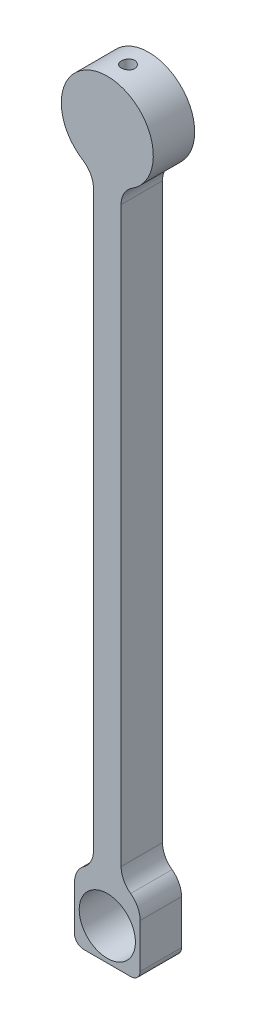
ISO-10303-21;
HEADER;
FILE_DESCRIPTION(('STEP AP214'),'2;1');
FILE_NAME('part.step','',(''),(''),'','','');
FILE_SCHEMA(('AUTOMOTIVE_DESIGN { 1 0 10303 214 1 1 1 1 }'));
ENDSEC;
DATA;
#1=APPLICATION_CONTEXT('core data for automotive mechanical design processes');
#2=APPLICATION_PROTOCOL_DEFINITION('international standard','automotive_design',2000,#1);
#3=PRODUCT_CONTEXT('',#1,'mechanical');
#4=PRODUCT('Part','Part','',(#3));
#5=PRODUCT_RELATED_PRODUCT_CATEGORY('part','',(#4));
#6=PRODUCT_DEFINITION_FORMATION('','',#4);
#7=PRODUCT_DEFINITION_CONTEXT('part definition',#1,'design');
#8=PRODUCT_DEFINITION('design','',#6,#7);
#9=PRODUCT_DEFINITION_SHAPE('','',#8);
#10=(LENGTH_UNIT() NAMED_UNIT(*) SI_UNIT(.MILLI.,.METRE.));
#11=(NAMED_UNIT(*) PLANE_ANGLE_UNIT() SI_UNIT($,.RADIAN.));
#12=(NAMED_UNIT(*) SI_UNIT($,.STERADIAN.) SOLID_ANGLE_UNIT());
#13=UNCERTAINTY_MEASURE_WITH_UNIT(LENGTH_MEASURE(1.E-05),#10,'distance_accuracy_value','');
#14=(GEOMETRIC_REPRESENTATION_CONTEXT(3) GLOBAL_UNCERTAINTY_ASSIGNED_CONTEXT((#13)) GLOBAL_UNIT_ASSIGNED_CONTEXT((#10,
#11,#12)) REPRESENTATION_CONTEXT('',''));
#15=CARTESIAN_POINT('',(0.,0.,0.));
#16=DIRECTION('',(0.,0.,1.));
#17=DIRECTION('',(1.,0.,0.));
#18=AXIS2_PLACEMENT_3D('',#15,#16,#17);
#19=CARTESIAN_POINT('',(0.,0.,9.));
#20=DIRECTION('',(0.,0.,-1.));
#21=DIRECTION('',(-1.,0.,0.));
#22=AXIS2_PLACEMENT_3D('',#19,#20,#21);
#23=CYLINDRICAL_SURFACE('',#22,3.3);
#24=DIRECTION('',(0.,0.,-1.));
#25=VECTOR('',#24,1.);
#26=CARTESIAN_POINT('',(-1.8629132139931,2.72388589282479,9.));
#27=LINE('',#26,#25);
#28=CARTESIAN_POINT('',(-1.8629132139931,2.72388589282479,7.));
#29=VERTEX_POINT('',#28);
#30=CARTESIAN_POINT('',(-1.8629132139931,2.72388589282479,0.));
#31=VERTEX_POINT('',#30);
#32=EDGE_CURVE('E169',#29,#31,#27,.T.);
#33=ORIENTED_EDGE('',*,*,#32,.F.);
#34=CARTESIAN_POINT('',(0.,0.,7.));
#35=DIRECTION('',(0.,0.,1.));
#36=DIRECTION('',(1.,0.,0.));
#37=AXIS2_PLACEMENT_3D('',#34,#35,#36);
#38=CIRCLE('',#37,3.3);
#39=CARTESIAN_POINT('',(1.8629132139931,2.72388589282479,7.));
#40=VERTEX_POINT('',#39);
#41=EDGE_CURVE('E173',#29,#40,#38,.T.);
#42=ORIENTED_EDGE('',*,*,#41,.T.);
#43=DIRECTION('',(0.,0.,-1.));
#44=VECTOR('',#43,1.);
#45=CARTESIAN_POINT('',(1.8629132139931,2.72388589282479,9.));
#46=LINE('',#45,#44);
#47=CARTESIAN_POINT('',(1.8629132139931,2.72388589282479,0.));
#48=VERTEX_POINT('',#47);
#49=EDGE_CURVE('E160',#40,#48,#46,.T.);
#50=ORIENTED_EDGE('',*,*,#49,.T.);
#51=CARTESIAN_POINT('',(0.,0.,0.));
#52=DIRECTION('',(0.,0.,1.));
#53=DIRECTION('',(1.,0.,0.));
#54=AXIS2_PLACEMENT_3D('',#51,#52,#53);
#55=CIRCLE('',#54,3.3);
#56=EDGE_CURVE('E265',#31,#48,#55,.T.);
#57=ORIENTED_EDGE('',*,*,#56,.F.);
#58=EDGE_LOOP('',(#33,#42,#50,#57));
#59=FACE_BOUND('',#58,.T.);
#60=ADVANCED_FACE('F42',(#59),#23,.F.);
#61=CARTESIAN_POINT('',(0.,2.72388589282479,9.));
#62=DIRECTION('',(0.,1.,0.));
#63=DIRECTION('',(0.,0.,1.));
#64=AXIS2_PLACEMENT_3D('',#61,#62,#63);
#65=PLANE('',#64);
#66=CARTESIAN_POINT('',(0.,2.72388589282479,4.5));
#67=DIRECTION('',(0.,1.,0.));
#68=DIRECTION('',(0.,0.,1.));
#69=AXIS2_PLACEMENT_3D('',#66,#67,#68);
#70=CIRCLE('',#69,1.45);
#71=CARTESIAN_POINT('',(0.,2.72388589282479,5.95));
#72=VERTEX_POINT('',#71);
#73=EDGE_CURVE('E176',#72,#72,#70,.T.);
#74=ORIENTED_EDGE('',*,*,#73,.T.);
#75=EDGE_LOOP('',(#74));
#76=FACE_BOUND('',#75,.T.);
#77=DIRECTION('',(-1.,0.,0.));
#78=VECTOR('',#77,1.);
#79=CARTESIAN_POINT('',(-1.8629132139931,2.72388589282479,7.));
#80=LINE('',#79,#78);
#81=EDGE_CURVE('E63',#40,#29,#80,.T.);
#82=ORIENTED_EDGE('',*,*,#81,.T.);
#83=ORIENTED_EDGE('',*,*,#32,.T.);
#84=DIRECTION('',(1.,0.,0.));
#85=VECTOR('',#84,1.);
#86=CARTESIAN_POINT('',(0.,2.72388589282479,0.));
#87=LINE('',#86,#85);
#88=EDGE_CURVE('E164',#31,#48,#87,.T.);
#89=ORIENTED_EDGE('',*,*,#88,.T.);
#90=ORIENTED_EDGE('',*,*,#49,.F.);
#91=EDGE_LOOP('',(#82,#83,#89,#90));
#92=FACE_BOUND('',#91,.T.);
#93=ADVANCED_FACE('F162',(#76,#92),#65,.F.);
#94=CARTESIAN_POINT('',(0.,0.,9.));
#95=DIRECTION('',(0.,0.,1.));
#96=DIRECTION('',(1.,0.,0.));
#97=AXIS2_PLACEMENT_3D('',#94,#95,#96);
#98=PLANE('',#97);
#99=CARTESIAN_POINT('',(-8.,-137.31142245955,9.));
#100=DIRECTION('',(0.,0.,-1.));
#101=DIRECTION('',(-1.,0.,0.));
#102=AXIS2_PLACEMENT_3D('',#99,#100,#101);
#103=CIRCLE('',#102,5.00000000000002);
#104=CARTESIAN_POINT('',(-5.07071421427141,-141.363494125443,9.));
#105=VERTEX_POINT('',#104);
#106=CARTESIAN_POINT('',(-3.,-137.31142245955,9.));
#107=VERTEX_POINT('',#106);
#108=EDGE_CURVE('E180',#105,#107,#103,.F.);
#109=ORIENTED_EDGE('',*,*,#108,.F.);
#110=CARTESIAN_POINT('',(-2.14142842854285,-145.415565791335,9.));
#111=DIRECTION('',(0.,0.,1.));
#112=DIRECTION('',(1.,0.,0.));
#113=AXIS2_PLACEMENT_3D('',#110,#111,#112);
#114=CIRCLE('',#113,5.);
#115=CARTESIAN_POINT('',(-7.14142842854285,-145.415565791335,9.));
#116=VERTEX_POINT('',#115);
#117=EDGE_CURVE('E305',#105,#116,#114,.T.);
#118=ORIENTED_EDGE('',*,*,#117,.T.);
#119=DIRECTION('',(0.,1.,0.));
#120=VECTOR('',#119,1.);
#121=CARTESIAN_POINT('',(-7.14142842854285,-157.,9.));
#122=LINE('',#121,#120);
#123=CARTESIAN_POINT('',(-7.14142842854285,-155.,9.));
#124=VERTEX_POINT('',#123);
#125=EDGE_CURVE('E242',#124,#116,#122,.T.);
#126=ORIENTED_EDGE('',*,*,#125,.F.);
#127=CARTESIAN_POINT('',(-5.14142842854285,-155.,9.));
#128=DIRECTION('',(0.,0.,1.));
#129=DIRECTION('',(1.,0.,0.));
#130=AXIS2_PLACEMENT_3D('',#127,#128,#129);
#131=CIRCLE('',#130,2.);
#132=CARTESIAN_POINT('',(-5.14142842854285,-157.,9.));
#133=VERTEX_POINT('',#132);
#134=EDGE_CURVE('E364',#124,#133,#131,.T.);
#135=ORIENTED_EDGE('',*,*,#134,.T.);
#136=DIRECTION('',(-1.,0.,0.));
#137=VECTOR('',#136,1.);
#138=CARTESIAN_POINT('',(7.14142842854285,-157.,9.));
#139=LINE('',#138,#137);
#140=CARTESIAN_POINT('',(5.14142842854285,-157.,9.));
#141=VERTEX_POINT('',#140);
#142=EDGE_CURVE('E238',#141,#133,#139,.T.);
#143=ORIENTED_EDGE('',*,*,#142,.F.);
#144=CARTESIAN_POINT('',(5.14142842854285,-155.,9.));
#145=DIRECTION('',(0.,0.,1.));
#146=DIRECTION('',(1.,0.,0.));
#147=AXIS2_PLACEMENT_3D('',#144,#145,#146);
#148=CIRCLE('',#147,2.);
#149=CARTESIAN_POINT('',(7.14142842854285,-155.,9.));
#150=VERTEX_POINT('',#149);
#151=EDGE_CURVE('E323',#141,#150,#148,.T.);
#152=ORIENTED_EDGE('',*,*,#151,.T.);
#153=DIRECTION('',(0.,1.,0.));
#154=VECTOR('',#153,1.);
#155=CARTESIAN_POINT('',(7.14142842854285,-157.,9.));
#156=LINE('',#155,#154);
#157=CARTESIAN_POINT('',(7.14142842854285,-145.415565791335,9.));
#158=VERTEX_POINT('',#157);
#159=EDGE_CURVE('E246',#150,#158,#156,.T.);
#160=ORIENTED_EDGE('',*,*,#159,.T.);
#161=CARTESIAN_POINT('',(2.14142842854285,-145.415565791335,9.));
#162=DIRECTION('',(0.,0.,1.));
#163=DIRECTION('',(1.,0.,0.));
#164=AXIS2_PLACEMENT_3D('',#161,#162,#163);
#165=CIRCLE('',#164,5.);
#166=CARTESIAN_POINT('',(5.07071421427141,-141.363494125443,9.));
#167=VERTEX_POINT('',#166);
#168=EDGE_CURVE('E71',#158,#167,#165,.T.);
#169=ORIENTED_EDGE('',*,*,#168,.T.);
#170=CARTESIAN_POINT('',(8.,-137.31142245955,9.));
#171=DIRECTION('',(0.,0.,-1.));
#172=DIRECTION('',(-1.,0.,0.));
#173=AXIS2_PLACEMENT_3D('',#170,#171,#172);
#174=CIRCLE('',#173,5.00000000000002);
#175=CARTESIAN_POINT('',(3.,-137.31142245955,9.));
#176=VERTEX_POINT('',#175);
#177=EDGE_CURVE('E187',#167,#176,#174,.T.);
#178=ORIENTED_EDGE('',*,*,#177,.T.);
#179=DIRECTION('',(0.,-1.,0.));
#180=VECTOR('',#179,1.);
#181=CARTESIAN_POINT('',(3.,0.,9.));
#182=LINE('',#181,#180);
#183=CARTESIAN_POINT('',(3.,-12.6885775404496,9.));
#184=VERTEX_POINT('',#183);
#185=EDGE_CURVE('E190',#184,#176,#182,.T.);
#186=ORIENTED_EDGE('',*,*,#185,.F.);
#187=CARTESIAN_POINT('',(8.,-12.6885775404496,9.));
#188=DIRECTION('',(0.,0.,-1.));
#189=DIRECTION('',(-1.,0.,0.));
#190=AXIS2_PLACEMENT_3D('',#187,#188,#189);
#191=CIRCLE('',#190,5.00000000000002);
#192=CARTESIAN_POINT('',(5.33333333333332,-8.45905169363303,9.));
#193=VERTEX_POINT('',#192);
#194=EDGE_CURVE('E195',#193,#184,#191,.F.);
#195=ORIENTED_EDGE('',*,*,#194,.F.);
#196=CARTESIAN_POINT('',(0.,0.,9.));
#197=DIRECTION('',(0.,0.,1.));
#198=DIRECTION('',(1.,0.,0.));
#199=AXIS2_PLACEMENT_3D('',#196,#197,#198);
#200=CIRCLE('',#199,10.);
#201=CARTESIAN_POINT('',(-5.33333333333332,-8.45905169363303,9.));
#202=VERTEX_POINT('',#201);
#203=EDGE_CURVE('E170',#193,#202,#200,.T.);
#204=ORIENTED_EDGE('',*,*,#203,.T.);
#205=CARTESIAN_POINT('',(-8.,-12.6885775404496,9.));
#206=DIRECTION('',(0.,0.,-1.));
#207=DIRECTION('',(-1.,0.,0.));
#208=AXIS2_PLACEMENT_3D('',#205,#206,#207);
#209=CIRCLE('',#208,5.00000000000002);
#210=CARTESIAN_POINT('',(-3.,-12.6885775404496,9.));
#211=VERTEX_POINT('',#210);
#212=EDGE_CURVE('E183',#202,#211,#209,.T.);
#213=ORIENTED_EDGE('',*,*,#212,.T.);
#214=DIRECTION('',(0.,-1.,0.));
#215=VECTOR('',#214,1.);
#216=CARTESIAN_POINT('',(-3.,0.,9.));
#217=LINE('',#216,#215);
#218=EDGE_CURVE('E213',#211,#107,#217,.T.);
#219=ORIENTED_EDGE('',*,*,#218,.T.);
#220=EDGE_LOOP('',(#109,#118,#126,#135,#143,#152,#160,#169,#178,#186,#195,#204,#213,#219));
#221=FACE_BOUND('',#220,.T.);
#222=CARTESIAN_POINT('',(0.,-150.,9.));
#223=DIRECTION('',(0.,0.,1.));
#224=DIRECTION('',(1.,0.,0.));
#225=AXIS2_PLACEMENT_3D('',#222,#223,#224);
#226=CIRCLE('',#225,6.11);
#227=CARTESIAN_POINT('',(6.11,-150.,9.));
#228=VERTEX_POINT('',#227);
#229=EDGE_CURVE('E230',#228,#228,#226,.T.);
#230=ORIENTED_EDGE('',*,*,#229,.F.);
#231=EDGE_LOOP('',(#230));
#232=FACE_BOUND('',#231,.T.);
#233=ADVANCED_FACE('F320',(#221,#232),#98,.T.);
#234=CARTESIAN_POINT('',(0.,0.,0.));
#235=DIRECTION('',(0.,0.,1.));
#236=DIRECTION('',(1.,0.,0.));
#237=AXIS2_PLACEMENT_3D('',#234,#235,#236);
#238=PLANE('',#237);
#239=DIRECTION('',(0.,1.,0.));
#240=VECTOR('',#239,1.);
#241=CARTESIAN_POINT('',(-7.14142842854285,-157.,0.));
#242=LINE('',#241,#240);
#243=CARTESIAN_POINT('',(-7.14142842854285,-155.,0.));
#244=VERTEX_POINT('',#243);
#245=CARTESIAN_POINT('',(-7.14142842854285,-145.415565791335,0.));
#246=VERTEX_POINT('',#245);
#247=EDGE_CURVE('E259',#244,#246,#242,.T.);
#248=ORIENTED_EDGE('',*,*,#247,.T.);
#249=CARTESIAN_POINT('',(-2.14142842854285,-145.415565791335,0.));
#250=DIRECTION('',(0.,0.,1.));
#251=DIRECTION('',(1.,0.,0.));
#252=AXIS2_PLACEMENT_3D('',#249,#250,#251);
#253=CIRCLE('',#252,5.);
#254=CARTESIAN_POINT('',(-5.07071421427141,-141.363494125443,0.));
#255=VERTEX_POINT('',#254);
#256=EDGE_CURVE('E297',#246,#255,#253,.F.);
#257=ORIENTED_EDGE('',*,*,#256,.T.);
#258=CARTESIAN_POINT('',(-8.,-137.31142245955,0.));
#259=DIRECTION('',(0.,0.,1.));
#260=DIRECTION('',(1.,0.,0.));
#261=AXIS2_PLACEMENT_3D('',#258,#259,#260);
#262=CIRCLE('',#261,5.00000000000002);
#263=CARTESIAN_POINT('',(-3.,-137.31142245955,0.));
#264=VERTEX_POINT('',#263);
#265=EDGE_CURVE('E266',#264,#255,#262,.F.);
#266=ORIENTED_EDGE('',*,*,#265,.F.);
#267=DIRECTION('',(0.,1.,0.));
#268=VECTOR('',#267,1.);
#269=CARTESIAN_POINT('',(-3.,0.,0.));
#270=LINE('',#269,#268);
#271=CARTESIAN_POINT('',(-3.,-12.6885775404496,0.));
#272=VERTEX_POINT('',#271);
#273=EDGE_CURVE('E270',#264,#272,#270,.T.);
#274=ORIENTED_EDGE('',*,*,#273,.T.);
#275=CARTESIAN_POINT('',(-8.,-12.6885775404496,0.));
#276=DIRECTION('',(0.,0.,1.));
#277=DIRECTION('',(1.,0.,0.));
#278=AXIS2_PLACEMENT_3D('',#275,#276,#277);
#279=CIRCLE('',#278,5.00000000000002);
#280=CARTESIAN_POINT('',(-5.33333333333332,-8.45905169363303,0.));
#281=VERTEX_POINT('',#280);
#282=EDGE_CURVE('E271',#272,#281,#279,.T.);
#283=ORIENTED_EDGE('',*,*,#282,.T.);
#284=CARTESIAN_POINT('',(0.,0.,0.));
#285=DIRECTION('',(0.,0.,1.));
#286=DIRECTION('',(1.,0.,0.));
#287=AXIS2_PLACEMENT_3D('',#284,#285,#286);
#288=CIRCLE('',#287,10.);
#289=CARTESIAN_POINT('',(5.33333333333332,-8.45905169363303,0.));
#290=VERTEX_POINT('',#289);
#291=EDGE_CURVE('E344',#290,#281,#288,.T.);
#292=ORIENTED_EDGE('',*,*,#291,.F.);
#293=CARTESIAN_POINT('',(8.,-12.6885775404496,0.));
#294=DIRECTION('',(0.,0.,1.));
#295=DIRECTION('',(1.,0.,0.));
#296=AXIS2_PLACEMENT_3D('',#293,#294,#295);
#297=CIRCLE('',#296,5.00000000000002);
#298=CARTESIAN_POINT('',(3.,-12.6885775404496,0.));
#299=VERTEX_POINT('',#298);
#300=EDGE_CURVE('E280',#299,#290,#297,.F.);
#301=ORIENTED_EDGE('',*,*,#300,.F.);
#302=DIRECTION('',(0.,1.,0.));
#303=VECTOR('',#302,1.);
#304=CARTESIAN_POINT('',(3.,0.,0.));
#305=LINE('',#304,#303);
#306=CARTESIAN_POINT('',(3.,-137.31142245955,0.));
#307=VERTEX_POINT('',#306);
#308=EDGE_CURVE('E279',#307,#299,#305,.T.);
#309=ORIENTED_EDGE('',*,*,#308,.F.);
#310=CARTESIAN_POINT('',(8.,-137.31142245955,0.));
#311=DIRECTION('',(0.,0.,1.));
#312=DIRECTION('',(1.,0.,0.));
#313=AXIS2_PLACEMENT_3D('',#310,#311,#312);
#314=CIRCLE('',#313,5.00000000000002);
#315=CARTESIAN_POINT('',(5.07071421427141,-141.363494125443,0.));
#316=VERTEX_POINT('',#315);
#317=EDGE_CURVE('E275',#307,#316,#314,.T.);
#318=ORIENTED_EDGE('',*,*,#317,.T.);
#319=CARTESIAN_POINT('',(2.14142842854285,-145.415565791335,0.));
#320=DIRECTION('',(0.,0.,1.));
#321=DIRECTION('',(1.,0.,0.));
#322=AXIS2_PLACEMENT_3D('',#319,#320,#321);
#323=CIRCLE('',#322,5.);
#324=CARTESIAN_POINT('',(7.14142842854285,-145.415565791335,0.));
#325=VERTEX_POINT('',#324);
#326=EDGE_CURVE('E294',#316,#325,#323,.F.);
#327=ORIENTED_EDGE('',*,*,#326,.T.);
#328=DIRECTION('',(0.,1.,0.));
#329=VECTOR('',#328,1.);
#330=CARTESIAN_POINT('',(7.14142842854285,-157.,0.));
#331=LINE('',#330,#329);
#332=CARTESIAN_POINT('',(7.14142842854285,-155.,0.));
#333=VERTEX_POINT('',#332);
#334=EDGE_CURVE('E249',#333,#325,#331,.T.);
#335=ORIENTED_EDGE('',*,*,#334,.F.);
#336=CARTESIAN_POINT('',(5.14142842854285,-155.,0.));
#337=DIRECTION('',(0.,0.,1.));
#338=DIRECTION('',(1.,0.,0.));
#339=AXIS2_PLACEMENT_3D('',#336,#337,#338);
#340=CIRCLE('',#339,2.);
#341=CARTESIAN_POINT('',(5.14142842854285,-157.,0.));
#342=VERTEX_POINT('',#341);
#343=EDGE_CURVE('E374',#333,#342,#340,.F.);
#344=ORIENTED_EDGE('',*,*,#343,.T.);
#345=DIRECTION('',(1.,0.,0.));
#346=VECTOR('',#345,1.);
#347=CARTESIAN_POINT('',(-7.14142842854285,-157.,0.));
#348=LINE('',#347,#346);
#349=CARTESIAN_POINT('',(-5.14142842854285,-157.,0.));
#350=VERTEX_POINT('',#349);
#351=EDGE_CURVE('E234',#350,#342,#348,.T.);
#352=ORIENTED_EDGE('',*,*,#351,.F.);
#353=CARTESIAN_POINT('',(-5.14142842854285,-155.,0.));
#354=DIRECTION('',(0.,0.,1.));
#355=DIRECTION('',(1.,0.,0.));
#356=AXIS2_PLACEMENT_3D('',#353,#354,#355);
#357=CIRCLE('',#356,2.);
#358=EDGE_CURVE('E372',#350,#244,#357,.F.);
#359=ORIENTED_EDGE('',*,*,#358,.T.);
#360=EDGE_LOOP('',(#248,#257,#266,#274,#283,#292,#301,#309,#318,#327,#335,#344,#352,#359));
#361=FACE_BOUND('',#360,.T.);
#362=CARTESIAN_POINT('',(0.,-150.,0.));
#363=DIRECTION('',(0.,0.,-1.));
#364=DIRECTION('',(-1.,0.,0.));
#365=AXIS2_PLACEMENT_3D('',#362,#363,#364);
#366=CIRCLE('',#365,6.11);
#367=CARTESIAN_POINT('',(-6.11,-150.,0.));
#368=VERTEX_POINT('',#367);
#369=EDGE_CURVE('E203',#368,#368,#366,.T.);
#370=ORIENTED_EDGE('',*,*,#369,.F.);
#371=EDGE_LOOP('',(#370));
#372=FACE_BOUND('',#371,.T.);
#373=ORIENTED_EDGE('',*,*,#56,.T.);
#374=ORIENTED_EDGE('',*,*,#88,.F.);
#375=EDGE_LOOP('',(#373,#374));
#376=FACE_BOUND('',#375,.T.);
#377=ADVANCED_FACE('F330',(#361,#372,#376),#238,.F.);
#378=CARTESIAN_POINT('',(7.14142842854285,-157.,0.));
#379=DIRECTION('',(-1.,0.,0.));
#380=DIRECTION('',(0.,0.,1.));
#381=AXIS2_PLACEMENT_3D('',#378,#379,#380);
#382=PLANE('',#381);
#383=ORIENTED_EDGE('',*,*,#334,.T.);
#384=DIRECTION('',(0.,0.,-1.));
#385=VECTOR('',#384,1.);
#386=CARTESIAN_POINT('',(7.14142842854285,-145.415565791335,0.));
#387=LINE('',#386,#385);
#388=EDGE_CURVE('E56',#325,#158,#387,.F.);
#389=ORIENTED_EDGE('',*,*,#388,.T.);
#390=ORIENTED_EDGE('',*,*,#159,.F.);
#391=DIRECTION('',(0.,0.,1.));
#392=VECTOR('',#391,1.);
#393=CARTESIAN_POINT('',(7.14142842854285,-155.,0.));
#394=LINE('',#393,#392);
#395=EDGE_CURVE('E369',#150,#333,#394,.F.);
#396=ORIENTED_EDGE('',*,*,#395,.T.);
#397=EDGE_LOOP('',(#383,#389,#390,#396));
#398=FACE_BOUND('',#397,.T.);
#399=ADVANCED_FACE('F315',(#398),#382,.F.);
#400=CARTESIAN_POINT('',(0.,0.,9.));
#401=DIRECTION('',(0.,0.,-1.));
#402=DIRECTION('',(-1.,0.,0.));
#403=AXIS2_PLACEMENT_3D('',#400,#401,#402);
#404=CYLINDRICAL_SURFACE('',#403,10.);
#405=CARTESIAN_POINT('',(0.,10.,5.95));
#406=CARTESIAN_POINT('',(-0.0809915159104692,9.9999987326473,5.94999663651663));
#407=CARTESIAN_POINT('',(-0.162030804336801,9.99900572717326,5.94319127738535));
#408=CARTESIAN_POINT('',(-0.321846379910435,9.99513998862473,5.91615530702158));
#409=CARTESIAN_POINT('',(-0.400620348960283,9.99226539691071,5.89591142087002));
#410=CARTESIAN_POINT('',(-0.553569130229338,9.984959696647,5.84261417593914));
#411=CARTESIAN_POINT('',(-0.627747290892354,9.98052973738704,5.80957027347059));
#412=CARTESIAN_POINT('',(-0.769493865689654,9.97060349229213,5.73163360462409));
#413=CARTESIAN_POINT('',(-0.837063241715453,9.96510736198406,5.6867425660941));
#414=CARTESIAN_POINT('',(-0.964180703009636,9.95361550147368,5.58603558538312));
#415=CARTESIAN_POINT('',(-1.02367340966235,9.94761673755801,5.53015008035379));
#416=CARTESIAN_POINT('',(-1.13247112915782,9.93581960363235,5.40919020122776));
#417=CARTESIAN_POINT('',(-1.18177557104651,9.93002124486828,5.34411531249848));
#418=CARTESIAN_POINT('',(-1.26901088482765,9.91925193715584,5.20625428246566));
#419=CARTESIAN_POINT('',(-1.30688852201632,9.91428490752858,5.13343412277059));
#420=CARTESIAN_POINT('',(-1.36985487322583,9.90578181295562,4.98238163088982));
#421=CARTESIAN_POINT('',(-1.39494423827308,9.90224567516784,4.90414957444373));
#422=CARTESIAN_POINT('',(-1.43145060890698,9.89703441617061,4.74507496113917));
#423=CARTESIAN_POINT('',(-1.44296217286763,9.89534643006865,4.66425453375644));
#424=CARTESIAN_POINT('',(-1.45227903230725,9.8939834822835,4.50181281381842));
#425=CARTESIAN_POINT('',(-1.45008506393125,9.89430841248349,4.42019156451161));
#426=CARTESIAN_POINT('',(-1.43213048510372,9.896922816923,4.25913116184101));
#427=CARTESIAN_POINT('',(-1.41647493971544,9.89919707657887,4.17968001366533));
#428=CARTESIAN_POINT('',(-1.37220596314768,9.90543013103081,4.02454437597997));
#429=CARTESIAN_POINT('',(-1.34359218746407,9.90938897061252,3.94885998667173));
#430=CARTESIAN_POINT('',(-1.27410893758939,9.91856202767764,3.80308516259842));
#431=CARTESIAN_POINT('',(-1.23319471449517,9.92378081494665,3.73301635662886));
#432=CARTESIAN_POINT('',(-1.14030387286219,9.93488239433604,3.60069901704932));
#433=CARTESIAN_POINT('',(-1.08832657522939,9.94076522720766,3.53845096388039));
#434=CARTESIAN_POINT('',(-0.974207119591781,9.95259936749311,3.42293300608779));
#435=CARTESIAN_POINT('',(-0.911974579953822,9.95855080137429,3.36975236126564));
#436=CARTESIAN_POINT('',(-0.779419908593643,9.96980047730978,3.2745768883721));
#437=CARTESIAN_POINT('',(-0.709097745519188,9.9750987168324,3.23258210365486));
#438=CARTESIAN_POINT('',(-0.562284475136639,9.98445005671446,3.16096681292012));
#439=CARTESIAN_POINT('',(-0.485790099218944,9.98850249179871,3.13135291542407));
#440=CARTESIAN_POINT('',(-0.328842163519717,9.99489997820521,3.08541617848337));
#441=CARTESIAN_POINT('',(-0.248388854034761,9.99724513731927,3.06909249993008));
#442=CARTESIAN_POINT('',(-0.0865774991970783,9.99994961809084,3.05031761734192));
#443=CARTESIAN_POINT('',(-0.00523398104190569,10.0003265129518,3.04774364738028));
#444=CARTESIAN_POINT('',(0.156723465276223,9.99909975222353,3.05621579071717));
#445=CARTESIAN_POINT('',(0.237337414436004,9.9974961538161,3.06726151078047));
#446=CARTESIAN_POINT('',(0.39517758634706,9.99249946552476,3.10255741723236));
#447=CARTESIAN_POINT('',(0.472417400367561,9.98911444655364,3.12674806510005));
#448=CARTESIAN_POINT('',(0.621744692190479,9.98093335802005,3.18758454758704));
#449=CARTESIAN_POINT('',(0.693831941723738,9.97613722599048,3.22423093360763));
#450=CARTESIAN_POINT('',(0.831349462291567,9.96562352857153,3.30922857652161));
#451=CARTESIAN_POINT('',(0.896730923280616,9.95989989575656,3.35765803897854));
#452=CARTESIAN_POINT('',(1.01848194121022,9.94818790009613,3.46473784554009));
#453=CARTESIAN_POINT('',(1.07485101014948,9.94219952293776,3.52338874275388));
#454=CARTESIAN_POINT('',(1.17742146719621,9.93057755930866,3.64979187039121));
#455=CARTESIAN_POINT('',(1.22354075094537,9.92494707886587,3.71761105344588));
#456=CARTESIAN_POINT('',(1.30373253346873,9.91473259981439,3.86010566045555));
#457=CARTESIAN_POINT('',(1.33780534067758,9.91014857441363,3.93478090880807));
#458=CARTESIAN_POINT('',(1.39280849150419,9.90256825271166,4.08861877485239));
#459=CARTESIAN_POINT('',(1.41378269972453,9.89956666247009,4.16776543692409));
#460=CARTESIAN_POINT('',(1.44213326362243,9.89547675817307,4.32850446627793));
#461=CARTESIAN_POINT('',(1.44951049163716,9.89438832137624,4.41009667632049));
#462=CARTESIAN_POINT('',(1.45043794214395,9.89425233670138,4.57259270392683));
#463=CARTESIAN_POINT('',(1.44411723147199,9.89518573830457,4.65349579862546));
#464=CARTESIAN_POINT('',(1.41810410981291,9.89894695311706,4.81307573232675));
#465=CARTESIAN_POINT('',(1.39841171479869,9.90177476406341,4.89175257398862));
#466=CARTESIAN_POINT('',(1.34625875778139,9.90899967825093,5.04461487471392));
#467=CARTESIAN_POINT('',(1.31380662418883,9.91339574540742,5.1188032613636));
#468=CARTESIAN_POINT('',(1.23706815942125,9.92326319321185,5.26070311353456));
#469=CARTESIAN_POINT('',(1.19278148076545,9.92873460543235,5.32841438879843));
#470=CARTESIAN_POINT('',(1.09315992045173,9.94019772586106,5.45609462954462));
#471=CARTESIAN_POINT('',(1.03772929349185,9.94619366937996,5.5159885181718));
#472=CARTESIAN_POINT('',(0.917595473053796,9.95799445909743,5.62567089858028));
#473=CARTESIAN_POINT('',(0.852890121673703,9.96379926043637,5.67545703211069));
#474=CARTESIAN_POINT('',(0.715654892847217,9.97459753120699,5.7637368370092));
#475=CARTESIAN_POINT('',(0.643086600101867,9.9795866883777,5.80217130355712));
#476=CARTESIAN_POINT('',(0.492488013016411,9.98814904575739,5.86624963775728));
#477=CARTESIAN_POINT('',(0.414463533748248,9.99172372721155,5.89190689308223));
#478=CARTESIAN_POINT('',(0.280064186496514,9.99622850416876,5.9238125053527));
#479=CARTESIAN_POINT('',(0.224523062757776,9.99763563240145,5.93361800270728));
#480=CARTESIAN_POINT('',(0.112662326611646,9.99952181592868,5.94671288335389));
#481=CARTESIAN_POINT('',(0.0563427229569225,10.0000008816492,5.95000233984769));
#482=CARTESIAN_POINT('',(0.,10.,5.95));
#483=B_SPLINE_CURVE_WITH_KNOTS('',3,(#405,#406,#407,#408,#409,#410,#411,#412,#413,#414,#415,
#416,#417,#418,#419,#420,#421,#422,#423,#424,#425,#426,#427,#428,#429,#430,#431,#432,#433,#434,
#435,#436,#437,#438,#439,#440,#441,#442,#443,#444,#445,#446,#447,#448,#449,#450,#451,#452,#453,
#454,#455,#456,#457,#458,#459,#460,#461,#462,#463,#464,#465,#466,#467,#468,#469,#470,#471,#472,
#473,#474,#475,#476,#477,#478,#479,#480,#481,#482),.UNSPECIFIED.,.T.,.F.,(4,2,2,2,2,2,2,2,2,2,2,
2,2,2,2,2,2,2,2,2,2,2,2,2,2,2,2,2,2,2,2,2,2,2,2,2,2,2,4),(0.,0.242768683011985,
0.485777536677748,0.728607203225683,0.971401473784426,1.21578441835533,1.46018105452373,
1.7056992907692,1.95120502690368,2.19499072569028,2.43876333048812,2.68065042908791,
2.92254395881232,3.16532836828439,3.40812768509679,3.65319411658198,3.89826149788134,
4.14345952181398,4.38864206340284,4.63163175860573,4.87461443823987,5.11650561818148,
5.35840750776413,5.60196095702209,5.84552758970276,6.09098008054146,6.33642628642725,
6.58104607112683,6.82565016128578,7.06795953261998,7.31026861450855,7.55241790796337,
7.79457431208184,8.03890773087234,8.28329809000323,8.52894143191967,8.77432684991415,
8.94321370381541,9.11209866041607),.UNSPECIFIED.);
#484=CARTESIAN_POINT('',(0.,10.,5.95));
#485=VERTEX_POINT('',#484);
#486=EDGE_CURVE('E12',#485,#485,#483,.T.);
#487=ORIENTED_EDGE('',*,*,#486,.T.);
#488=EDGE_LOOP('',(#487));
#489=FACE_BOUND('',#488,.T.);
#490=ORIENTED_EDGE('',*,*,#291,.T.);
#491=DIRECTION('',(0.,0.,-1.));
#492=VECTOR('',#491,1.);
#493=CARTESIAN_POINT('',(-5.33333333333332,-8.45905169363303,9.));
#494=LINE('',#493,#492);
#495=EDGE_CURVE('E217',#202,#281,#494,.T.);
#496=ORIENTED_EDGE('',*,*,#495,.F.);
#497=ORIENTED_EDGE('',*,*,#203,.F.);
#498=DIRECTION('',(0.,0.,-1.));
#499=VECTOR('',#498,1.);
#500=CARTESIAN_POINT('',(5.33333333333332,-8.45905169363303,9.));
#501=LINE('',#500,#499);
#502=EDGE_CURVE('E199',#193,#290,#501,.T.);
#503=ORIENTED_EDGE('',*,*,#502,.T.);
#504=EDGE_LOOP('',(#490,#496,#497,#503));
#505=FACE_BOUND('',#504,.T.);
#506=ADVANCED_FACE('F343',(#489,#505),#404,.T.);
#507=CARTESIAN_POINT('',(-7.14142842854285,-157.,9.));
#508=DIRECTION('',(1.,0.,0.));
#509=DIRECTION('',(0.,0.,-1.));
#510=AXIS2_PLACEMENT_3D('',#507,#508,#509);
#511=PLANE('',#510);
#512=ORIENTED_EDGE('',*,*,#125,.T.);
#513=DIRECTION('',(0.,0.,1.));
#514=VECTOR('',#513,1.);
#515=CARTESIAN_POINT('',(-7.14142842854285,-145.415565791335,0.));
#516=LINE('',#515,#514);
#517=EDGE_CURVE('E284',#116,#246,#516,.F.);
#518=ORIENTED_EDGE('',*,*,#517,.T.);
#519=ORIENTED_EDGE('',*,*,#247,.F.);
#520=DIRECTION('',(0.,0.,-1.));
#521=VECTOR('',#520,1.);
#522=CARTESIAN_POINT('',(-7.14142842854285,-155.,9.));
#523=LINE('',#522,#521);
#524=EDGE_CURVE('E260',#244,#124,#523,.F.);
#525=ORIENTED_EDGE('',*,*,#524,.T.);
#526=EDGE_LOOP('',(#512,#518,#519,#525));
#527=FACE_BOUND('',#526,.T.);
#528=ADVANCED_FACE('F383',(#527),#511,.F.);
#529=CARTESIAN_POINT('',(0.,-157.,0.));
#530=DIRECTION('',(0.,-1.,0.));
#531=DIRECTION('',(0.,0.,-1.));
#532=AXIS2_PLACEMENT_3D('',#529,#530,#531);
#533=PLANE('',#532);
#534=ORIENTED_EDGE('',*,*,#351,.T.);
#535=DIRECTION('',(0.,0.,1.));
#536=VECTOR('',#535,1.);
#537=CARTESIAN_POINT('',(5.14142842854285,-157.,9.));
#538=LINE('',#537,#536);
#539=EDGE_CURVE('E360',#342,#141,#538,.T.);
#540=ORIENTED_EDGE('',*,*,#539,.T.);
#541=ORIENTED_EDGE('',*,*,#142,.T.);
#542=DIRECTION('',(0.,0.,-1.));
#543=VECTOR('',#542,1.);
#544=CARTESIAN_POINT('',(-5.14142842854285,-157.,0.));
#545=LINE('',#544,#543);
#546=EDGE_CURVE('E356',#133,#350,#545,.T.);
#547=ORIENTED_EDGE('',*,*,#546,.T.);
#548=EDGE_LOOP('',(#534,#540,#541,#547));
#549=FACE_BOUND('',#548,.T.);
#550=ADVANCED_FACE('F391',(#549),#533,.T.);
#551=CARTESIAN_POINT('',(0.,-150.,10.));
#552=DIRECTION('',(0.,0.,-1.));
#553=DIRECTION('',(-1.,0.,0.));
#554=AXIS2_PLACEMENT_3D('',#551,#552,#553);
#555=CYLINDRICAL_SURFACE('',#554,6.11);
#556=ORIENTED_EDGE('',*,*,#229,.T.);
#557=EDGE_LOOP('',(#556));
#558=FACE_BOUND('',#557,.T.);
#559=ORIENTED_EDGE('',*,*,#369,.T.);
#560=EDGE_LOOP('',(#559));
#561=FACE_BOUND('',#560,.T.);
#562=ADVANCED_FACE('F421',(#558,#561),#555,.F.);
#563=CARTESIAN_POINT('',(5.14142842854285,-155.,0.));
#564=DIRECTION('',(0.,0.,-1.));
#565=DIRECTION('',(-1.,0.,0.));
#566=AXIS2_PLACEMENT_3D('',#563,#564,#565);
#567=CYLINDRICAL_SURFACE('',#566,2.);
#568=ORIENTED_EDGE('',*,*,#343,.F.);
#569=ORIENTED_EDGE('',*,*,#395,.F.);
#570=ORIENTED_EDGE('',*,*,#151,.F.);
#571=ORIENTED_EDGE('',*,*,#539,.F.);
#572=EDGE_LOOP('',(#568,#569,#570,#571));
#573=FACE_BOUND('',#572,.T.);
#574=ADVANCED_FACE('F419',(#573),#567,.T.);
#575=CARTESIAN_POINT('',(-5.14142842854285,-155.,0.));
#576=DIRECTION('',(0.,0.,1.));
#577=DIRECTION('',(1.,0.,0.));
#578=AXIS2_PLACEMENT_3D('',#575,#576,#577);
#579=CYLINDRICAL_SURFACE('',#578,2.);
#580=ORIENTED_EDGE('',*,*,#134,.F.);
#581=ORIENTED_EDGE('',*,*,#524,.F.);
#582=ORIENTED_EDGE('',*,*,#358,.F.);
#583=ORIENTED_EDGE('',*,*,#546,.F.);
#584=EDGE_LOOP('',(#580,#581,#582,#583));
#585=FACE_BOUND('',#584,.T.);
#586=ADVANCED_FACE('F389',(#585),#579,.T.);
#587=CARTESIAN_POINT('',(8.,-12.6885775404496,9.));
#588=DIRECTION('',(0.,0.,-1.));
#589=DIRECTION('',(-1.,0.,0.));
#590=AXIS2_PLACEMENT_3D('',#587,#588,#589);
#591=CYLINDRICAL_SURFACE('',#590,5.00000000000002);
#592=ORIENTED_EDGE('',*,*,#300,.T.);
#593=ORIENTED_EDGE('',*,*,#502,.F.);
#594=ORIENTED_EDGE('',*,*,#194,.T.);
#595=DIRECTION('',(0.,0.,-1.));
#596=VECTOR('',#595,1.);
#597=CARTESIAN_POINT('',(3.,-12.6885775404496,9.));
#598=LINE('',#597,#596);
#599=EDGE_CURVE('E204',#184,#299,#598,.T.);
#600=ORIENTED_EDGE('',*,*,#599,.T.);
#601=EDGE_LOOP('',(#592,#593,#594,#600));
#602=FACE_BOUND('',#601,.T.);
#603=ADVANCED_FACE('F341',(#602),#591,.F.);
#604=CARTESIAN_POINT('',(3.,0.,9.));
#605=DIRECTION('',(1.,0.,0.));
#606=DIRECTION('',(0.,0.,-1.));
#607=AXIS2_PLACEMENT_3D('',#604,#605,#606);
#608=PLANE('',#607);
#609=ORIENTED_EDGE('',*,*,#308,.T.);
#610=ORIENTED_EDGE('',*,*,#599,.F.);
#611=ORIENTED_EDGE('',*,*,#185,.T.);
#612=DIRECTION('',(0.,0.,-1.));
#613=VECTOR('',#612,1.);
#614=CARTESIAN_POINT('',(3.,-137.31142245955,9.));
#615=LINE('',#614,#613);
#616=EDGE_CURVE('E198',#176,#307,#615,.T.);
#617=ORIENTED_EDGE('',*,*,#616,.T.);
#618=EDGE_LOOP('',(#609,#610,#611,#617));
#619=FACE_BOUND('',#618,.T.);
#620=ADVANCED_FACE('F335',(#619),#608,.T.);
#621=CARTESIAN_POINT('',(8.,-137.31142245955,9.));
#622=DIRECTION('',(0.,0.,-1.));
#623=DIRECTION('',(-1.,0.,0.));
#624=AXIS2_PLACEMENT_3D('',#621,#622,#623);
#625=CYLINDRICAL_SURFACE('',#624,5.00000000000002);
#626=ORIENTED_EDGE('',*,*,#177,.F.);
#627=DIRECTION('',(0.,0.,-1.));
#628=VECTOR('',#627,1.);
#629=CARTESIAN_POINT('',(5.07071421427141,-141.363494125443,9.));
#630=LINE('',#629,#628);
#631=EDGE_CURVE('E308',#167,#316,#630,.T.);
#632=ORIENTED_EDGE('',*,*,#631,.T.);
#633=ORIENTED_EDGE('',*,*,#317,.F.);
#634=ORIENTED_EDGE('',*,*,#616,.F.);
#635=EDGE_LOOP('',(#626,#632,#633,#634));
#636=FACE_BOUND('',#635,.T.);
#637=ADVANCED_FACE('F326',(#636),#625,.F.);
#638=CARTESIAN_POINT('',(-8.,-137.31142245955,9.));
#639=DIRECTION('',(0.,0.,-1.));
#640=DIRECTION('',(-1.,0.,0.));
#641=AXIS2_PLACEMENT_3D('',#638,#639,#640);
#642=CYLINDRICAL_SURFACE('',#641,5.00000000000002);
#643=ORIENTED_EDGE('',*,*,#265,.T.);
#644=DIRECTION('',(0.,0.,-1.));
#645=VECTOR('',#644,1.);
#646=CARTESIAN_POINT('',(-5.07071421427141,-141.363494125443,9.));
#647=LINE('',#646,#645);
#648=EDGE_CURVE('E300',#255,#105,#647,.F.);
#649=ORIENTED_EDGE('',*,*,#648,.T.);
#650=ORIENTED_EDGE('',*,*,#108,.T.);
#651=DIRECTION('',(0.,0.,-1.));
#652=VECTOR('',#651,1.);
#653=CARTESIAN_POINT('',(-3.,-137.31142245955,9.));
#654=LINE('',#653,#652);
#655=EDGE_CURVE('E191',#107,#264,#654,.T.);
#656=ORIENTED_EDGE('',*,*,#655,.T.);
#657=EDGE_LOOP('',(#643,#649,#650,#656));
#658=FACE_BOUND('',#657,.T.);
#659=ADVANCED_FACE('F397',(#658),#642,.F.);
#660=CARTESIAN_POINT('',(-3.,0.,9.));
#661=DIRECTION('',(1.,0.,0.));
#662=DIRECTION('',(0.,0.,-1.));
#663=AXIS2_PLACEMENT_3D('',#660,#661,#662);
#664=PLANE('',#663);
#665=ORIENTED_EDGE('',*,*,#655,.F.);
#666=ORIENTED_EDGE('',*,*,#218,.F.);
#667=DIRECTION('',(0.,0.,-1.));
#668=VECTOR('',#667,1.);
#669=CARTESIAN_POINT('',(-3.,-12.6885775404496,9.));
#670=LINE('',#669,#668);
#671=EDGE_CURVE('E221',#211,#272,#670,.T.);
#672=ORIENTED_EDGE('',*,*,#671,.T.);
#673=ORIENTED_EDGE('',*,*,#273,.F.);
#674=EDGE_LOOP('',(#665,#666,#672,#673));
#675=FACE_BOUND('',#674,.T.);
#676=ADVANCED_FACE('F407',(#675),#664,.F.);
#677=CARTESIAN_POINT('',(-8.,-12.6885775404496,9.));
#678=DIRECTION('',(0.,0.,-1.));
#679=DIRECTION('',(-1.,0.,0.));
#680=AXIS2_PLACEMENT_3D('',#677,#678,#679);
#681=CYLINDRICAL_SURFACE('',#680,5.00000000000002);
#682=ORIENTED_EDGE('',*,*,#671,.F.);
#683=ORIENTED_EDGE('',*,*,#212,.F.);
#684=ORIENTED_EDGE('',*,*,#495,.T.);
#685=ORIENTED_EDGE('',*,*,#282,.F.);
#686=EDGE_LOOP('',(#682,#683,#684,#685));
#687=FACE_BOUND('',#686,.T.);
#688=ADVANCED_FACE('F402',(#687),#681,.F.);
#689=CARTESIAN_POINT('',(-2.14142842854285,-145.415565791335,9.));
#690=DIRECTION('',(0.,0.,-1.));
#691=DIRECTION('',(-1.,0.,0.));
#692=AXIS2_PLACEMENT_3D('',#689,#690,#691);
#693=CYLINDRICAL_SURFACE('',#692,5.);
#694=ORIENTED_EDGE('',*,*,#117,.F.);
#695=ORIENTED_EDGE('',*,*,#648,.F.);
#696=ORIENTED_EDGE('',*,*,#256,.F.);
#697=ORIENTED_EDGE('',*,*,#517,.F.);
#698=EDGE_LOOP('',(#694,#695,#696,#697));
#699=FACE_BOUND('',#698,.T.);
#700=ADVANCED_FACE('F400',(#699),#693,.T.);
#701=CARTESIAN_POINT('',(2.14142842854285,-145.415565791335,9.));
#702=DIRECTION('',(0.,0.,-1.));
#703=DIRECTION('',(-1.,0.,0.));
#704=AXIS2_PLACEMENT_3D('',#701,#702,#703);
#705=CYLINDRICAL_SURFACE('',#704,5.);
#706=ORIENTED_EDGE('',*,*,#168,.F.);
#707=ORIENTED_EDGE('',*,*,#388,.F.);
#708=ORIENTED_EDGE('',*,*,#326,.F.);
#709=ORIENTED_EDGE('',*,*,#631,.F.);
#710=EDGE_LOOP('',(#706,#707,#708,#709));
#711=FACE_BOUND('',#710,.T.);
#712=ADVANCED_FACE('F44',(#711),#705,.T.);
#713=CARTESIAN_POINT('',(0.,0.,7.));
#714=DIRECTION('',(0.,0.,1.));
#715=DIRECTION('',(1.,0.,0.));
#716=AXIS2_PLACEMENT_3D('',#713,#714,#715);
#717=PLANE('',#716);
#718=ORIENTED_EDGE('',*,*,#41,.F.);
#719=ORIENTED_EDGE('',*,*,#81,.F.);
#720=EDGE_LOOP('',(#718,#719));
#721=FACE_BOUND('',#720,.T.);
#722=ADVANCED_FACE('F178',(#721),#717,.F.);
#723=CARTESIAN_POINT('',(0.,0.,4.5));
#724=DIRECTION('',(0.,1.,0.));
#725=DIRECTION('',(0.,0.,1.));
#726=AXIS2_PLACEMENT_3D('',#723,#724,#725);
#727=CYLINDRICAL_SURFACE('',#726,1.45);
#728=ORIENTED_EDGE('',*,*,#486,.F.);
#729=EDGE_LOOP('',(#728));
#730=FACE_BOUND('',#729,.T.);
#731=ORIENTED_EDGE('',*,*,#73,.F.);
#732=EDGE_LOOP('',(#731));
#733=FACE_BOUND('',#732,.T.);
#734=ADVANCED_FACE('F460',(#730,#733),#727,.F.);
#735=CLOSED_SHELL('',(#60,#93,#233,#377,#399,#506,#528,#550,#562,#574,#586,#603,#620,#637,#659,
#676,#688,#700,#712,#722,#734));
#736=MANIFOLD_SOLID_BREP('B2',#735);
#737=ADVANCED_BREP_SHAPE_REPRESENTATION('',(#18,#736),#14);
#738=SHAPE_DEFINITION_REPRESENTATION(#9,#737);
ENDSEC;
END-ISO-10303-21;
